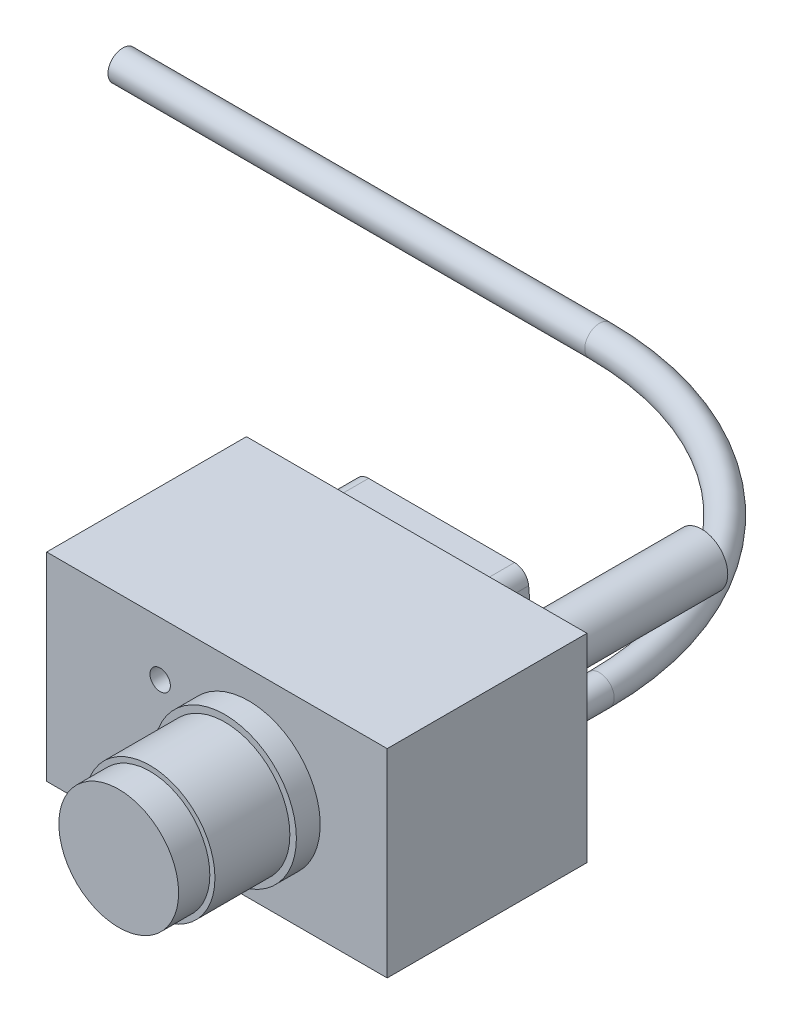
ISO-10303-21;
HEADER;
FILE_DESCRIPTION(('STEP AP214'),'2;1');
FILE_NAME('part.step','',(''),(''),'','','');
FILE_SCHEMA(('AUTOMOTIVE_DESIGN { 1 0 10303 214 1 1 1 1 }'));
ENDSEC;
DATA;
#1=APPLICATION_CONTEXT('core data for automotive mechanical design processes');
#2=APPLICATION_PROTOCOL_DEFINITION('international standard','automotive_design',2000,#1);
#3=PRODUCT_CONTEXT('',#1,'mechanical');
#4=PRODUCT('Part','Part','',(#3));
#5=PRODUCT_RELATED_PRODUCT_CATEGORY('part','',(#4));
#6=PRODUCT_DEFINITION_FORMATION('','',#4);
#7=PRODUCT_DEFINITION_CONTEXT('part definition',#1,'design');
#8=PRODUCT_DEFINITION('design','',#6,#7);
#9=PRODUCT_DEFINITION_SHAPE('','',#8);
#10=(LENGTH_UNIT() NAMED_UNIT(*) SI_UNIT(.MILLI.,.METRE.));
#11=(NAMED_UNIT(*) PLANE_ANGLE_UNIT() SI_UNIT($,.RADIAN.));
#12=(NAMED_UNIT(*) SI_UNIT($,.STERADIAN.) SOLID_ANGLE_UNIT());
#13=UNCERTAINTY_MEASURE_WITH_UNIT(LENGTH_MEASURE(1.E-05),#10,'distance_accuracy_value','');
#14=(GEOMETRIC_REPRESENTATION_CONTEXT(3) GLOBAL_UNCERTAINTY_ASSIGNED_CONTEXT((#13)) GLOBAL_UNIT_ASSIGNED_CONTEXT((#10,
#11,#12)) REPRESENTATION_CONTEXT('',''));
#15=CARTESIAN_POINT('',(0.,0.,0.));
#16=DIRECTION('',(0.,0.,1.));
#17=DIRECTION('',(1.,0.,0.));
#18=AXIS2_PLACEMENT_3D('',#15,#16,#17);
#19=CARTESIAN_POINT('',(38.1,22.225,-22.352));
#20=DIRECTION('',(0.,0.,1.));
#21=DIRECTION('',(1.,0.,0.));
#22=AXIS2_PLACEMENT_3D('',#19,#20,#21);
#23=PLANE('',#22);
#24=CARTESIAN_POINT('',(28.194,0.,-22.352));
#25=DIRECTION('',(0.,0.,1.));
#26=DIRECTION('',(1.,0.,0.));
#27=AXIS2_PLACEMENT_3D('',#24,#25,#26);
#28=CIRCLE('',#27,6.35);
#29=CARTESIAN_POINT('',(34.544,0.,-22.352));
#30=VERTEX_POINT('',#29);
#31=EDGE_CURVE('E41',#30,#30,#28,.F.);
#32=ORIENTED_EDGE('',*,*,#31,.F.);
#33=EDGE_LOOP('',(#32));
#34=FACE_BOUND('',#33,.T.);
#35=DIRECTION('',(-1.,0.,0.));
#36=VECTOR('',#35,1.);
#37=CARTESIAN_POINT('',(38.1,-22.225,-22.352));
#38=LINE('',#37,#36);
#39=CARTESIAN_POINT('',(38.1,-22.225,-22.352));
#40=VERTEX_POINT('',#39);
#41=CARTESIAN_POINT('',(-38.1,-22.225,-22.352));
#42=VERTEX_POINT('',#41);
#43=EDGE_CURVE('E192',#40,#42,#38,.T.);
#44=ORIENTED_EDGE('',*,*,#43,.T.);
#45=DIRECTION('',(0.,-1.,0.));
#46=VECTOR('',#45,1.);
#47=CARTESIAN_POINT('',(-38.1,22.225,-22.352));
#48=LINE('',#47,#46);
#49=CARTESIAN_POINT('',(-38.1,22.225,-22.352));
#50=VERTEX_POINT('',#49);
#51=EDGE_CURVE('E189',#50,#42,#48,.T.);
#52=ORIENTED_EDGE('',*,*,#51,.F.);
#53=DIRECTION('',(-1.,0.,0.));
#54=VECTOR('',#53,1.);
#55=CARTESIAN_POINT('',(38.1,22.225,-22.352));
#56=LINE('',#55,#54);
#57=CARTESIAN_POINT('',(38.1,22.225,-22.352));
#58=VERTEX_POINT('',#57);
#59=EDGE_CURVE('E84',#58,#50,#56,.T.);
#60=ORIENTED_EDGE('',*,*,#59,.F.);
#61=DIRECTION('',(0.,-1.,0.));
#62=VECTOR('',#61,1.);
#63=CARTESIAN_POINT('',(38.1,22.225,-22.352));
#64=LINE('',#63,#62);
#65=EDGE_CURVE('E203',#58,#40,#64,.T.);
#66=ORIENTED_EDGE('',*,*,#65,.T.);
#67=EDGE_LOOP('',(#44,#52,#60,#66));
#68=FACE_BOUND('',#67,.T.);
#69=CARTESIAN_POINT('',(9.50530829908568,8.22959999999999,-22.352));
#70=DIRECTION('',(0.,0.,-1.));
#71=DIRECTION('',(-1.,0.,0.));
#72=AXIS2_PLACEMENT_3D('',#69,#70,#71);
#73=CIRCLE('',#72,3.175);
#74=CARTESIAN_POINT('',(12.668226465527,8.50631948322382,-22.352));
#75=VERTEX_POINT('',#74);
#76=CARTESIAN_POINT('',(9.50530829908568,5.05459999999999,-22.352));
#77=VERTEX_POINT('',#76);
#78=EDGE_CURVE('E157',#75,#77,#73,.T.);
#79=ORIENTED_EDGE('',*,*,#78,.F.);
#80=DIRECTION('',(-0.087155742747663,0.996194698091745,0.));
#81=VECTOR('',#80,1.);
#82=CARTESIAN_POINT('',(12.668226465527,8.50631948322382,-22.352));
#83=LINE('',#82,#81);
#84=CARTESIAN_POINT('',(12.3437835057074,12.2147194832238,-22.352));
#85=VERTEX_POINT('',#84);
#86=EDGE_CURVE('E153',#75,#85,#83,.T.);
#87=ORIENTED_EDGE('',*,*,#86,.T.);
#88=CARTESIAN_POINT('',(9.18086533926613,11.938,-22.352));
#89=DIRECTION('',(0.,0.,-1.));
#90=DIRECTION('',(-1.,0.,0.));
#91=AXIS2_PLACEMENT_3D('',#88,#89,#90);
#92=CIRCLE('',#91,3.175);
#93=CARTESIAN_POINT('',(9.18086533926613,15.113,-22.352));
#94=VERTEX_POINT('',#93);
#95=EDGE_CURVE('E48',#94,#85,#92,.T.);
#96=ORIENTED_EDGE('',*,*,#95,.F.);
#97=DIRECTION('',(1.,0.,0.));
#98=VECTOR('',#97,1.);
#99=CARTESIAN_POINT('',(-23.4684124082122,15.113,-22.352));
#100=LINE('',#99,#98);
#101=CARTESIAN_POINT('',(-23.4684124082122,15.113,-22.352));
#102=VERTEX_POINT('',#101);
#103=EDGE_CURVE('E250',#102,#94,#100,.T.);
#104=ORIENTED_EDGE('',*,*,#103,.F.);
#105=CARTESIAN_POINT('',(-23.4684124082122,11.938,-22.352));
#106=DIRECTION('',(0.,0.,-1.));
#107=DIRECTION('',(-1.,0.,0.));
#108=AXIS2_PLACEMENT_3D('',#105,#106,#107);
#109=CIRCLE('',#108,3.17500000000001);
#110=CARTESIAN_POINT('',(-26.6313305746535,12.2147194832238,-22.352));
#111=VERTEX_POINT('',#110);
#112=EDGE_CURVE('E248',#111,#102,#109,.T.);
#113=ORIENTED_EDGE('',*,*,#112,.F.);
#114=DIRECTION('',(-0.0871557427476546,-0.996194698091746,0.));
#115=VECTOR('',#114,1.);
#116=CARTESIAN_POINT('',(-26.6313305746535,12.2147194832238,-22.352));
#117=LINE('',#116,#115);
#118=CARTESIAN_POINT('',(-26.955773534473,8.50631948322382,-22.352));
#119=VERTEX_POINT('',#118);
#120=EDGE_CURVE('E245',#111,#119,#117,.T.);
#121=ORIENTED_EDGE('',*,*,#120,.T.);
#122=CARTESIAN_POINT('',(-23.7928553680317,8.22959999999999,-22.352));
#123=DIRECTION('',(0.,0.,1.));
#124=DIRECTION('',(1.,0.,0.));
#125=AXIS2_PLACEMENT_3D('',#122,#123,#124);
#126=CIRCLE('',#125,3.175);
#127=CARTESIAN_POINT('',(-23.7928553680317,5.05459999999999,-22.352));
#128=VERTEX_POINT('',#127);
#129=EDGE_CURVE('E242',#119,#128,#126,.T.);
#130=ORIENTED_EDGE('',*,*,#129,.T.);
#131=DIRECTION('',(-1.,0.,0.));
#132=VECTOR('',#131,1.);
#133=CARTESIAN_POINT('',(9.50530829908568,5.05459999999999,-22.352));
#134=LINE('',#133,#132);
#135=EDGE_CURVE('E240',#77,#128,#134,.T.);
#136=ORIENTED_EDGE('',*,*,#135,.F.);
#137=EDGE_LOOP('',(#79,#87,#96,#104,#113,#121,#130,#136));
#138=FACE_BOUND('',#137,.T.);
#139=CARTESIAN_POINT('',(28.194,13.843,-22.352));
#140=DIRECTION('',(0.,0.,1.));
#141=DIRECTION('',(1.,0.,0.));
#142=AXIS2_PLACEMENT_3D('',#139,#140,#141);
#143=CIRCLE('',#142,5.842);
#144=CARTESIAN_POINT('',(34.036,13.843,-22.352));
#145=VERTEX_POINT('',#144);
#146=EDGE_CURVE('E11',#145,#145,#143,.F.);
#147=ORIENTED_EDGE('',*,*,#146,.F.);
#148=EDGE_LOOP('',(#147));
#149=FACE_BOUND('',#148,.T.);
#150=ADVANCED_FACE('F33',(#34,#68,#138,#149),#23,.F.);
#151=CARTESIAN_POINT('',(28.194,0.,-24.892));
#152=DIRECTION('',(0.,0.,-1.));
#153=DIRECTION('',(-1.,0.,0.));
#154=AXIS2_PLACEMENT_3D('',#151,#152,#153);
#155=PLANE('',#154);
#156=CARTESIAN_POINT('',(28.194,0.,-24.892));
#157=DIRECTION('',(0.,0.,-1.));
#158=DIRECTION('',(-1.,0.,0.));
#159=AXIS2_PLACEMENT_3D('',#156,#157,#158);
#160=CIRCLE('',#159,6.35);
#161=CARTESIAN_POINT('',(21.844,0.,-24.892));
#162=VERTEX_POINT('',#161);
#163=EDGE_CURVE('E211',#162,#162,#160,.T.);
#164=ORIENTED_EDGE('',*,*,#163,.T.);
#165=EDGE_LOOP('',(#164));
#166=FACE_BOUND('',#165,.T.);
#167=CARTESIAN_POINT('',(28.194,0.,-24.892));
#168=DIRECTION('',(0.,0.,-1.));
#169=DIRECTION('',(-1.,0.,0.));
#170=AXIS2_PLACEMENT_3D('',#167,#168,#169);
#171=CIRCLE('',#170,3.302);
#172=CARTESIAN_POINT('',(24.892,0.,-24.892));
#173=VERTEX_POINT('',#172);
#174=EDGE_CURVE('E209',#173,#173,#171,.F.);
#175=ORIENTED_EDGE('',*,*,#174,.T.);
#176=EDGE_LOOP('',(#175));
#177=FACE_BOUND('',#176,.T.);
#178=ADVANCED_FACE('F298',(#166,#177),#155,.T.);
#179=CARTESIAN_POINT('',(7.11200000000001,0.,44.45));
#180=DIRECTION('',(0.,0.,1.));
#181=DIRECTION('',(1.,0.,0.));
#182=AXIS2_PLACEMENT_3D('',#179,#180,#181);
#183=PLANE('',#182);
#184=CARTESIAN_POINT('',(7.11200000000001,0.,44.45));
#185=DIRECTION('',(0.,0.,1.));
#186=DIRECTION('',(1.,0.,0.));
#187=AXIS2_PLACEMENT_3D('',#184,#185,#186);
#188=CIRCLE('',#187,14.5415);
#189=CARTESIAN_POINT('',(21.6535,0.,44.45));
#190=VERTEX_POINT('',#189);
#191=EDGE_CURVE('E171',#190,#190,#188,.T.);
#192=ORIENTED_EDGE('',*,*,#191,.T.);
#193=EDGE_LOOP('',(#192));
#194=FACE_BOUND('',#193,.T.);
#195=CARTESIAN_POINT('',(7.11200000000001,0.,44.45));
#196=DIRECTION('',(0.,0.,1.));
#197=DIRECTION('',(1.,0.,0.));
#198=AXIS2_PLACEMENT_3D('',#195,#196,#197);
#199=CIRCLE('',#198,13.3985);
#200=CARTESIAN_POINT('',(20.5105,0.,44.45));
#201=VERTEX_POINT('',#200);
#202=EDGE_CURVE('E159',#201,#201,#199,.T.);
#203=ORIENTED_EDGE('',*,*,#202,.F.);
#204=EDGE_LOOP('',(#203));
#205=FACE_BOUND('',#204,.T.);
#206=ADVANCED_FACE('F303',(#194,#205),#183,.T.);
#207=CARTESIAN_POINT('',(7.11200000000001,0.,27.686));
#208=DIRECTION('',(0.,0.,1.));
#209=DIRECTION('',(1.,0.,0.));
#210=AXIS2_PLACEMENT_3D('',#207,#208,#209);
#211=PLANE('',#210);
#212=CARTESIAN_POINT('',(7.11200000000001,0.,27.686));
#213=DIRECTION('',(0.,0.,1.));
#214=DIRECTION('',(1.,0.,0.));
#215=AXIS2_PLACEMENT_3D('',#212,#213,#214);
#216=CIRCLE('',#215,16.002);
#217=CARTESIAN_POINT('',(23.114,0.,27.686));
#218=VERTEX_POINT('',#217);
#219=EDGE_CURVE('E174',#218,#218,#216,.T.);
#220=ORIENTED_EDGE('',*,*,#219,.T.);
#221=EDGE_LOOP('',(#220));
#222=FACE_BOUND('',#221,.T.);
#223=CARTESIAN_POINT('',(7.11200000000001,0.,27.686));
#224=DIRECTION('',(0.,0.,1.));
#225=DIRECTION('',(1.,0.,0.));
#226=AXIS2_PLACEMENT_3D('',#223,#224,#225);
#227=CIRCLE('',#226,14.5415);
#228=CARTESIAN_POINT('',(21.6535,0.,27.686));
#229=VERTEX_POINT('',#228);
#230=EDGE_CURVE('E169',#229,#229,#227,.T.);
#231=ORIENTED_EDGE('',*,*,#230,.F.);
#232=EDGE_LOOP('',(#231));
#233=FACE_BOUND('',#232,.T.);
#234=ADVANCED_FACE('F317',(#222,#233),#211,.T.);
#235=CARTESIAN_POINT('',(-38.1,22.225,22.352));
#236=DIRECTION('',(0.,0.,-1.));
#237=DIRECTION('',(-1.,0.,0.));
#238=AXIS2_PLACEMENT_3D('',#235,#236,#237);
#239=PLANE('',#238);
#240=CARTESIAN_POINT('',(-12.7,10.16,22.352));
#241=DIRECTION('',(0.,0.,1.));
#242=DIRECTION('',(1.,0.,0.));
#243=AXIS2_PLACEMENT_3D('',#240,#241,#242);
#244=CIRCLE('',#243,2.286);
#245=CARTESIAN_POINT('',(-10.414,10.16,22.352));
#246=VERTEX_POINT('',#245);
#247=EDGE_CURVE('E511',#246,#246,#244,.T.);
#248=ORIENTED_EDGE('',*,*,#247,.F.);
#249=EDGE_LOOP('',(#248));
#250=FACE_BOUND('',#249,.T.);
#251=CARTESIAN_POINT('',(-12.7,-10.16,22.352));
#252=DIRECTION('',(0.,0.,1.));
#253=DIRECTION('',(1.,0.,0.));
#254=AXIS2_PLACEMENT_3D('',#251,#252,#253);
#255=CIRCLE('',#254,2.286);
#256=CARTESIAN_POINT('',(-10.414,-10.16,22.352));
#257=VERTEX_POINT('',#256);
#258=EDGE_CURVE('E510',#257,#257,#255,.T.);
#259=ORIENTED_EDGE('',*,*,#258,.F.);
#260=EDGE_LOOP('',(#259));
#261=FACE_BOUND('',#260,.T.);
#262=DIRECTION('',(1.,0.,0.));
#263=VECTOR('',#262,1.);
#264=CARTESIAN_POINT('',(-38.1,-22.225,22.352));
#265=LINE('',#264,#263);
#266=CARTESIAN_POINT('',(-38.1,-22.225,22.352));
#267=VERTEX_POINT('',#266);
#268=CARTESIAN_POINT('',(38.1,-22.225,22.352));
#269=VERTEX_POINT('',#268);
#270=EDGE_CURVE('E182',#267,#269,#265,.T.);
#271=ORIENTED_EDGE('',*,*,#270,.T.);
#272=DIRECTION('',(0.,-1.,0.));
#273=VECTOR('',#272,1.);
#274=CARTESIAN_POINT('',(38.1,22.225,22.352));
#275=LINE('',#274,#273);
#276=CARTESIAN_POINT('',(38.1,22.225,22.352));
#277=VERTEX_POINT('',#276);
#278=EDGE_CURVE('E201',#277,#269,#275,.T.);
#279=ORIENTED_EDGE('',*,*,#278,.F.);
#280=DIRECTION('',(1.,0.,0.));
#281=VECTOR('',#280,1.);
#282=CARTESIAN_POINT('',(-38.1,22.225,22.352));
#283=LINE('',#282,#281);
#284=CARTESIAN_POINT('',(-38.1,22.225,22.352));
#285=VERTEX_POINT('',#284);
#286=EDGE_CURVE('E187',#285,#277,#283,.T.);
#287=ORIENTED_EDGE('',*,*,#286,.F.);
#288=DIRECTION('',(0.,-1.,0.));
#289=VECTOR('',#288,1.);
#290=CARTESIAN_POINT('',(-38.1,22.225,22.352));
#291=LINE('',#290,#289);
#292=EDGE_CURVE('E57',#285,#267,#291,.T.);
#293=ORIENTED_EDGE('',*,*,#292,.T.);
#294=EDGE_LOOP('',(#271,#279,#287,#293));
#295=FACE_BOUND('',#294,.T.);
#296=CARTESIAN_POINT('',(7.11200000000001,0.,22.352));
#297=DIRECTION('',(0.,0.,-1.));
#298=DIRECTION('',(-1.,0.,0.));
#299=AXIS2_PLACEMENT_3D('',#296,#297,#298);
#300=CIRCLE('',#299,16.002);
#301=CARTESIAN_POINT('',(-8.89,0.,22.352));
#302=VERTEX_POINT('',#301);
#303=EDGE_CURVE('E200',#302,#302,#300,.F.);
#304=ORIENTED_EDGE('',*,*,#303,.F.);
#305=EDGE_LOOP('',(#304));
#306=FACE_BOUND('',#305,.T.);
#307=ADVANCED_FACE('F314',(#250,#261,#295,#306),#239,.F.);
#308=CARTESIAN_POINT('',(-38.1,22.225,22.352));
#309=DIRECTION('',(-1.,0.,0.));
#310=DIRECTION('',(0.,0.,1.));
#311=AXIS2_PLACEMENT_3D('',#308,#309,#310);
#312=PLANE('',#311);
#313=DIRECTION('',(0.,0.,-1.));
#314=VECTOR('',#313,1.);
#315=CARTESIAN_POINT('',(-38.1,-22.225,22.352));
#316=LINE('',#315,#314);
#317=EDGE_CURVE('E179',#267,#42,#316,.T.);
#318=ORIENTED_EDGE('',*,*,#317,.F.);
#319=ORIENTED_EDGE('',*,*,#292,.F.);
#320=DIRECTION('',(0.,0.,-1.));
#321=VECTOR('',#320,1.);
#322=CARTESIAN_POINT('',(-38.1,22.225,22.352));
#323=LINE('',#322,#321);
#324=EDGE_CURVE('E180',#285,#50,#323,.T.);
#325=ORIENTED_EDGE('',*,*,#324,.T.);
#326=ORIENTED_EDGE('',*,*,#51,.T.);
#327=EDGE_LOOP('',(#318,#319,#325,#326));
#328=FACE_BOUND('',#327,.T.);
#329=ADVANCED_FACE('F35',(#328),#312,.T.);
#330=CARTESIAN_POINT('',(38.1,22.225,-22.352));
#331=DIRECTION('',(1.,0.,0.));
#332=DIRECTION('',(0.,0.,-1.));
#333=AXIS2_PLACEMENT_3D('',#330,#331,#332);
#334=PLANE('',#333);
#335=DIRECTION('',(0.,0.,1.));
#336=VECTOR('',#335,1.);
#337=CARTESIAN_POINT('',(38.1,-22.225,-22.352));
#338=LINE('',#337,#336);
#339=EDGE_CURVE('E195',#40,#269,#338,.T.);
#340=ORIENTED_EDGE('',*,*,#339,.F.);
#341=ORIENTED_EDGE('',*,*,#65,.F.);
#342=DIRECTION('',(0.,0.,1.));
#343=VECTOR('',#342,1.);
#344=CARTESIAN_POINT('',(38.1,22.225,-22.352));
#345=LINE('',#344,#343);
#346=EDGE_CURVE('E184',#58,#277,#345,.T.);
#347=ORIENTED_EDGE('',*,*,#346,.T.);
#348=ORIENTED_EDGE('',*,*,#278,.T.);
#349=EDGE_LOOP('',(#340,#341,#347,#348));
#350=FACE_BOUND('',#349,.T.);
#351=ADVANCED_FACE('F309',(#350),#334,.T.);
#352=CARTESIAN_POINT('',(-38.1,22.225,22.352));
#353=DIRECTION('',(0.,-1.,0.));
#354=DIRECTION('',(0.,0.,-1.));
#355=AXIS2_PLACEMENT_3D('',#352,#353,#354);
#356=PLANE('',#355);
#357=ORIENTED_EDGE('',*,*,#324,.F.);
#358=ORIENTED_EDGE('',*,*,#286,.T.);
#359=ORIENTED_EDGE('',*,*,#346,.F.);
#360=ORIENTED_EDGE('',*,*,#59,.T.);
#361=EDGE_LOOP('',(#357,#358,#359,#360));
#362=FACE_BOUND('',#361,.T.);
#363=ADVANCED_FACE('F312',(#362),#356,.F.);
#364=CARTESIAN_POINT('',(-38.1,-22.225,22.352));
#365=DIRECTION('',(0.,-1.,0.));
#366=DIRECTION('',(0.,0.,-1.));
#367=AXIS2_PLACEMENT_3D('',#364,#365,#366);
#368=PLANE('',#367);
#369=ORIENTED_EDGE('',*,*,#317,.T.);
#370=ORIENTED_EDGE('',*,*,#43,.F.);
#371=ORIENTED_EDGE('',*,*,#339,.T.);
#372=ORIENTED_EDGE('',*,*,#270,.F.);
#373=EDGE_LOOP('',(#369,#370,#371,#372));
#374=FACE_BOUND('',#373,.T.);
#375=ADVANCED_FACE('F319',(#374),#368,.T.);
#376=CARTESIAN_POINT('',(7.11200000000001,0.,27.686));
#377=DIRECTION('',(0.,0.,-1.));
#378=DIRECTION('',(-1.,0.,0.));
#379=AXIS2_PLACEMENT_3D('',#376,#377,#378);
#380=CYLINDRICAL_SURFACE('',#379,16.002);
#381=ORIENTED_EDGE('',*,*,#219,.F.);
#382=EDGE_LOOP('',(#381));
#383=FACE_BOUND('',#382,.T.);
#384=ORIENTED_EDGE('',*,*,#303,.T.);
#385=EDGE_LOOP('',(#384));
#386=FACE_BOUND('',#385,.T.);
#387=ADVANCED_FACE('F322',(#383,#386),#380,.T.);
#388=CARTESIAN_POINT('',(7.11200000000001,0.,44.45));
#389=DIRECTION('',(0.,0.,-1.));
#390=DIRECTION('',(-1.,0.,0.));
#391=AXIS2_PLACEMENT_3D('',#388,#389,#390);
#392=CYLINDRICAL_SURFACE('',#391,14.5415);
#393=ORIENTED_EDGE('',*,*,#191,.F.);
#394=EDGE_LOOP('',(#393));
#395=FACE_BOUND('',#394,.T.);
#396=ORIENTED_EDGE('',*,*,#230,.T.);
#397=EDGE_LOOP('',(#396));
#398=FACE_BOUND('',#397,.T.);
#399=ADVANCED_FACE('F328',(#395,#398),#392,.T.);
#400=CARTESIAN_POINT('',(7.11200000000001,0.,51.435));
#401=DIRECTION('',(0.,0.,-1.));
#402=DIRECTION('',(-1.,0.,0.));
#403=AXIS2_PLACEMENT_3D('',#400,#401,#402);
#404=CYLINDRICAL_SURFACE('',#403,13.3985);
#405=CARTESIAN_POINT('',(7.11200000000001,0.,51.435));
#406=DIRECTION('',(0.,0.,1.));
#407=DIRECTION('',(1.,0.,0.));
#408=AXIS2_PLACEMENT_3D('',#405,#406,#407);
#409=CIRCLE('',#408,13.3985);
#410=CARTESIAN_POINT('',(20.5105,0.,51.435));
#411=VERTEX_POINT('',#410);
#412=EDGE_CURVE('E162',#411,#411,#409,.T.);
#413=ORIENTED_EDGE('',*,*,#412,.F.);
#414=EDGE_LOOP('',(#413));
#415=FACE_BOUND('',#414,.T.);
#416=ORIENTED_EDGE('',*,*,#202,.T.);
#417=EDGE_LOOP('',(#416));
#418=FACE_BOUND('',#417,.T.);
#419=ADVANCED_FACE('F335',(#415,#418),#404,.T.);
#420=CARTESIAN_POINT('',(7.11200000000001,0.,51.435));
#421=DIRECTION('',(0.,0.,1.));
#422=DIRECTION('',(1.,0.,0.));
#423=AXIS2_PLACEMENT_3D('',#420,#421,#422);
#424=PLANE('',#423);
#425=ORIENTED_EDGE('',*,*,#412,.T.);
#426=EDGE_LOOP('',(#425));
#427=FACE_BOUND('',#426,.T.);
#428=ADVANCED_FACE('F342',(#427),#424,.T.);
#429=CARTESIAN_POINT('',(9.50530829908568,8.22959999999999,-35.052));
#430=DIRECTION('',(0.,0.,1.));
#431=DIRECTION('',(1.,0.,0.));
#432=AXIS2_PLACEMENT_3D('',#429,#430,#431);
#433=CYLINDRICAL_SURFACE('',#432,3.175);
#434=ORIENTED_EDGE('',*,*,#78,.T.);
#435=DIRECTION('',(0.,0.,1.));
#436=VECTOR('',#435,1.);
#437=CARTESIAN_POINT('',(9.50530829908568,5.05459999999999,-35.052));
#438=LINE('',#437,#436);
#439=CARTESIAN_POINT('',(9.50530829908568,5.05459999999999,-35.052));
#440=VERTEX_POINT('',#439);
#441=EDGE_CURVE('E138',#440,#77,#438,.T.);
#442=ORIENTED_EDGE('',*,*,#441,.F.);
#443=CARTESIAN_POINT('',(9.50530829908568,8.22959999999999,-35.052));
#444=DIRECTION('',(0.,0.,-1.));
#445=DIRECTION('',(-1.,0.,0.));
#446=AXIS2_PLACEMENT_3D('',#443,#444,#445);
#447=CIRCLE('',#446,3.175);
#448=CARTESIAN_POINT('',(12.668226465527,8.50631948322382,-35.052));
#449=VERTEX_POINT('',#448);
#450=EDGE_CURVE('E145',#449,#440,#447,.T.);
#451=ORIENTED_EDGE('',*,*,#450,.F.);
#452=DIRECTION('',(0.,0.,1.));
#453=VECTOR('',#452,1.);
#454=CARTESIAN_POINT('',(12.668226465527,8.50631948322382,-35.052));
#455=LINE('',#454,#453);
#456=EDGE_CURVE('E238',#449,#75,#455,.T.);
#457=ORIENTED_EDGE('',*,*,#456,.T.);
#458=EDGE_LOOP('',(#434,#442,#451,#457));
#459=FACE_BOUND('',#458,.T.);
#460=ADVANCED_FACE('F155',(#459),#433,.T.);
#461=CARTESIAN_POINT('',(9.50530829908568,5.05459999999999,-35.052));
#462=DIRECTION('',(0.,1.,0.));
#463=DIRECTION('',(0.,0.,1.));
#464=AXIS2_PLACEMENT_3D('',#461,#462,#463);
#465=PLANE('',#464);
#466=ORIENTED_EDGE('',*,*,#135,.T.);
#467=DIRECTION('',(0.,0.,1.));
#468=VECTOR('',#467,1.);
#469=CARTESIAN_POINT('',(-23.7928553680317,5.05459999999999,-35.052));
#470=LINE('',#469,#468);
#471=CARTESIAN_POINT('',(-23.7928553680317,5.05459999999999,-35.052));
#472=VERTEX_POINT('',#471);
#473=EDGE_CURVE('E140',#472,#128,#470,.T.);
#474=ORIENTED_EDGE('',*,*,#473,.F.);
#475=DIRECTION('',(-1.,0.,0.));
#476=VECTOR('',#475,1.);
#477=CARTESIAN_POINT('',(9.50530829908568,5.05459999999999,-35.052));
#478=LINE('',#477,#476);
#479=EDGE_CURVE('E133',#440,#472,#478,.T.);
#480=ORIENTED_EDGE('',*,*,#479,.F.);
#481=ORIENTED_EDGE('',*,*,#441,.T.);
#482=EDGE_LOOP('',(#466,#474,#480,#481));
#483=FACE_BOUND('',#482,.T.);
#484=ADVANCED_FACE('F136',(#483),#465,.F.);
#485=CARTESIAN_POINT('',(-23.7928553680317,8.22959999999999,-35.052));
#486=DIRECTION('',(0.,0.,1.));
#487=DIRECTION('',(1.,0.,0.));
#488=AXIS2_PLACEMENT_3D('',#485,#486,#487);
#489=CYLINDRICAL_SURFACE('',#488,3.175);
#490=ORIENTED_EDGE('',*,*,#129,.F.);
#491=DIRECTION('',(0.,0.,1.));
#492=VECTOR('',#491,1.);
#493=CARTESIAN_POINT('',(-26.955773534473,8.50631948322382,-35.052));
#494=LINE('',#493,#492);
#495=CARTESIAN_POINT('',(-26.955773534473,8.50631948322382,-35.052));
#496=VERTEX_POINT('',#495);
#497=EDGE_CURVE('E164',#496,#119,#494,.T.);
#498=ORIENTED_EDGE('',*,*,#497,.F.);
#499=CARTESIAN_POINT('',(-23.7928553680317,8.22959999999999,-35.052));
#500=DIRECTION('',(0.,0.,1.));
#501=DIRECTION('',(1.,0.,0.));
#502=AXIS2_PLACEMENT_3D('',#499,#500,#501);
#503=CIRCLE('',#502,3.175);
#504=EDGE_CURVE('E144',#496,#472,#503,.T.);
#505=ORIENTED_EDGE('',*,*,#504,.T.);
#506=ORIENTED_EDGE('',*,*,#473,.T.);
#507=EDGE_LOOP('',(#490,#498,#505,#506));
#508=FACE_BOUND('',#507,.T.);
#509=ADVANCED_FACE('F271',(#508),#489,.T.);
#510=CARTESIAN_POINT('',(-26.6313305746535,12.2147194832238,-35.052));
#511=DIRECTION('',(-0.996194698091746,0.0871557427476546,0.));
#512=DIRECTION('',(-0.0871557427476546,-0.996194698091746,0.));
#513=AXIS2_PLACEMENT_3D('',#510,#511,#512);
#514=PLANE('',#513);
#515=ORIENTED_EDGE('',*,*,#120,.F.);
#516=DIRECTION('',(0.,0.,1.));
#517=VECTOR('',#516,1.);
#518=CARTESIAN_POINT('',(-26.6313305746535,12.2147194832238,-35.052));
#519=LINE('',#518,#517);
#520=CARTESIAN_POINT('',(-26.6313305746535,12.2147194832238,-35.052));
#521=VERTEX_POINT('',#520);
#522=EDGE_CURVE('E263',#521,#111,#519,.T.);
#523=ORIENTED_EDGE('',*,*,#522,.F.);
#524=DIRECTION('',(-0.0871557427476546,-0.996194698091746,0.));
#525=VECTOR('',#524,1.);
#526=CARTESIAN_POINT('',(-26.6313305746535,12.2147194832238,-35.052));
#527=LINE('',#526,#525);
#528=EDGE_CURVE('E228',#521,#496,#527,.T.);
#529=ORIENTED_EDGE('',*,*,#528,.T.);
#530=ORIENTED_EDGE('',*,*,#497,.T.);
#531=EDGE_LOOP('',(#515,#523,#529,#530));
#532=FACE_BOUND('',#531,.T.);
#533=ADVANCED_FACE('F267',(#532),#514,.T.);
#534=CARTESIAN_POINT('',(-23.4684124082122,11.938,-35.052));
#535=DIRECTION('',(0.,0.,1.));
#536=DIRECTION('',(1.,0.,0.));
#537=AXIS2_PLACEMENT_3D('',#534,#535,#536);
#538=CYLINDRICAL_SURFACE('',#537,3.17500000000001);
#539=ORIENTED_EDGE('',*,*,#112,.T.);
#540=DIRECTION('',(0.,0.,1.));
#541=VECTOR('',#540,1.);
#542=CARTESIAN_POINT('',(-23.4684124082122,15.113,-35.052));
#543=LINE('',#542,#541);
#544=CARTESIAN_POINT('',(-23.4684124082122,15.113,-35.052));
#545=VERTEX_POINT('',#544);
#546=EDGE_CURVE('E260',#545,#102,#543,.T.);
#547=ORIENTED_EDGE('',*,*,#546,.F.);
#548=CARTESIAN_POINT('',(-23.4684124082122,11.938,-35.052));
#549=DIRECTION('',(0.,0.,-1.));
#550=DIRECTION('',(-1.,0.,0.));
#551=AXIS2_PLACEMENT_3D('',#548,#549,#550);
#552=CIRCLE('',#551,3.17500000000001);
#553=EDGE_CURVE('E231',#521,#545,#552,.T.);
#554=ORIENTED_EDGE('',*,*,#553,.F.);
#555=ORIENTED_EDGE('',*,*,#522,.T.);
#556=EDGE_LOOP('',(#539,#547,#554,#555));
#557=FACE_BOUND('',#556,.T.);
#558=ADVANCED_FACE('F277',(#557),#538,.T.);
#559=CARTESIAN_POINT('',(-23.4684124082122,15.113,-35.052));
#560=DIRECTION('',(0.,-1.,0.));
#561=DIRECTION('',(1.,0.,0.));
#562=AXIS2_PLACEMENT_3D('',#559,#560,#561);
#563=PLANE('',#562);
#564=ORIENTED_EDGE('',*,*,#103,.T.);
#565=DIRECTION('',(0.,0.,1.));
#566=VECTOR('',#565,1.);
#567=CARTESIAN_POINT('',(9.18086533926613,15.113,-35.052));
#568=LINE('',#567,#566);
#569=CARTESIAN_POINT('',(9.18086533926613,15.113,-35.052));
#570=VERTEX_POINT('',#569);
#571=EDGE_CURVE('E258',#570,#94,#568,.T.);
#572=ORIENTED_EDGE('',*,*,#571,.F.);
#573=DIRECTION('',(1.,0.,0.));
#574=VECTOR('',#573,1.);
#575=CARTESIAN_POINT('',(-23.4684124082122,15.113,-35.052));
#576=LINE('',#575,#574);
#577=EDGE_CURVE('E233',#545,#570,#576,.T.);
#578=ORIENTED_EDGE('',*,*,#577,.F.);
#579=ORIENTED_EDGE('',*,*,#546,.T.);
#580=EDGE_LOOP('',(#564,#572,#578,#579));
#581=FACE_BOUND('',#580,.T.);
#582=ADVANCED_FACE('F281',(#581),#563,.F.);
#583=CARTESIAN_POINT('',(9.18086533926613,11.938,-35.052));
#584=DIRECTION('',(0.,0.,1.));
#585=DIRECTION('',(1.,0.,0.));
#586=AXIS2_PLACEMENT_3D('',#583,#584,#585);
#587=CYLINDRICAL_SURFACE('',#586,3.175);
#588=ORIENTED_EDGE('',*,*,#95,.T.);
#589=DIRECTION('',(0.,0.,1.));
#590=VECTOR('',#589,1.);
#591=CARTESIAN_POINT('',(12.3437835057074,12.2147194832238,-35.052));
#592=LINE('',#591,#590);
#593=CARTESIAN_POINT('',(12.3437835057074,12.2147194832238,-35.052));
#594=VERTEX_POINT('',#593);
#595=EDGE_CURVE('E256',#594,#85,#592,.T.);
#596=ORIENTED_EDGE('',*,*,#595,.F.);
#597=CARTESIAN_POINT('',(9.18086533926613,11.938,-35.052));
#598=DIRECTION('',(0.,0.,-1.));
#599=DIRECTION('',(-1.,0.,0.));
#600=AXIS2_PLACEMENT_3D('',#597,#598,#599);
#601=CIRCLE('',#600,3.175);
#602=EDGE_CURVE('E235',#570,#594,#601,.T.);
#603=ORIENTED_EDGE('',*,*,#602,.F.);
#604=ORIENTED_EDGE('',*,*,#571,.T.);
#605=EDGE_LOOP('',(#588,#596,#603,#604));
#606=FACE_BOUND('',#605,.T.);
#607=ADVANCED_FACE('F284',(#606),#587,.T.);
#608=CARTESIAN_POINT('',(12.668226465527,8.50631948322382,-35.052));
#609=DIRECTION('',(0.996194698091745,0.087155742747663,0.));
#610=DIRECTION('',(-0.087155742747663,0.996194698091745,0.));
#611=AXIS2_PLACEMENT_3D('',#608,#609,#610);
#612=PLANE('',#611);
#613=ORIENTED_EDGE('',*,*,#86,.F.);
#614=ORIENTED_EDGE('',*,*,#456,.F.);
#615=DIRECTION('',(-0.087155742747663,0.996194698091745,0.));
#616=VECTOR('',#615,1.);
#617=CARTESIAN_POINT('',(12.668226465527,8.50631948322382,-35.052));
#618=LINE('',#617,#616);
#619=EDGE_CURVE('E151',#449,#594,#618,.T.);
#620=ORIENTED_EDGE('',*,*,#619,.T.);
#621=ORIENTED_EDGE('',*,*,#595,.T.);
#622=EDGE_LOOP('',(#613,#614,#620,#621));
#623=FACE_BOUND('',#622,.T.);
#624=ADVANCED_FACE('F287',(#623),#612,.T.);
#625=CARTESIAN_POINT('',(9.50530829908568,8.22959999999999,-35.052));
#626=DIRECTION('',(0.,0.,-1.));
#627=DIRECTION('',(-1.,0.,0.));
#628=AXIS2_PLACEMENT_3D('',#625,#626,#627);
#629=PLANE('',#628);
#630=ORIENTED_EDGE('',*,*,#450,.T.);
#631=ORIENTED_EDGE('',*,*,#479,.T.);
#632=ORIENTED_EDGE('',*,*,#504,.F.);
#633=ORIENTED_EDGE('',*,*,#528,.F.);
#634=ORIENTED_EDGE('',*,*,#553,.T.);
#635=ORIENTED_EDGE('',*,*,#577,.T.);
#636=ORIENTED_EDGE('',*,*,#602,.T.);
#637=ORIENTED_EDGE('',*,*,#619,.F.);
#638=EDGE_LOOP('',(#630,#631,#632,#633,#634,#635,#636,#637));
#639=FACE_BOUND('',#638,.T.);
#640=ADVANCED_FACE('F149',(#639),#629,.T.);
#641=CARTESIAN_POINT('',(28.194,0.,-24.892));
#642=DIRECTION('',(0.,0.,1.));
#643=DIRECTION('',(1.,0.,0.));
#644=AXIS2_PLACEMENT_3D('',#641,#642,#643);
#645=CYLINDRICAL_SURFACE('',#644,6.35);
#646=ORIENTED_EDGE('',*,*,#163,.F.);
#647=EDGE_LOOP('',(#646));
#648=FACE_BOUND('',#647,.T.);
#649=ORIENTED_EDGE('',*,*,#31,.T.);
#650=EDGE_LOOP('',(#649));
#651=FACE_BOUND('',#650,.T.);
#652=ADVANCED_FACE('F294',(#648,#651),#645,.T.);
#653=CARTESIAN_POINT('',(-39.4969999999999,7.0830860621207E-13,-102.743));
#654=DIRECTION('',(-1.,0.,0.));
#655=DIRECTION('',(0.,-1.,0.));
#656=AXIS2_PLACEMENT_3D('',#653,#654,#655);
#657=CYLINDRICAL_SURFACE('',#656,3.302);
#658=CARTESIAN_POINT('',(-39.4969999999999,7.0830860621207E-13,-102.743));
#659=DIRECTION('',(-1.,0.,0.));
#660=DIRECTION('',(0.,0.,1.));
#661=AXIS2_PLACEMENT_3D('',#658,#659,#660);
#662=CIRCLE('',#661,3.302);
#663=CARTESIAN_POINT('',(-39.4969999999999,7.0830860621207E-13,-106.045));
#664=VERTEX_POINT('',#663);
#665=EDGE_CURVE('E218',#664,#664,#662,.T.);
#666=ORIENTED_EDGE('',*,*,#665,.T.);
#667=EDGE_LOOP('',(#666));
#668=FACE_BOUND('',#667,.T.);
#669=CARTESIAN_POINT('',(-146.177,1.82459233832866E-12,-102.742999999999));
#670=DIRECTION('',(-1.,0.,0.));
#671=DIRECTION('',(0.,0.,1.));
#672=AXIS2_PLACEMENT_3D('',#669,#670,#671);
#673=CIRCLE('',#672,3.302);
#674=CARTESIAN_POINT('',(-146.177,1.79004069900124E-12,-99.4409999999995));
#675=VERTEX_POINT('',#674);
#676=EDGE_CURVE('E212',#675,#675,#673,.T.);
#677=ORIENTED_EDGE('',*,*,#676,.F.);
#678=EDGE_LOOP('',(#677));
#679=FACE_BOUND('',#678,.T.);
#680=ADVANCED_FACE('F385',(#668,#679),#657,.T.);
#681=CARTESIAN_POINT('',(-39.4969999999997,7.08308606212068E-13,-35.0519999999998));
#682=DIRECTION('',(0.,1.,0.));
#683=DIRECTION('',(-1.,0.,0.));
#684=AXIS2_PLACEMENT_3D('',#681,#682,#683);
#685=TOROIDAL_SURFACE('',#684,67.6909999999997,3.302);
#686=CARTESIAN_POINT('',(28.194,0.,-35.052));
#687=DIRECTION('',(0.,0.,-1.));
#688=DIRECTION('',(-1.,0.,0.));
#689=AXIS2_PLACEMENT_3D('',#686,#687,#688);
#690=CIRCLE('',#689,3.302);
#691=CARTESIAN_POINT('',(31.496,0.,-35.052));
#692=VERTEX_POINT('',#691);
#693=EDGE_CURVE('E223',#692,#692,#690,.T.);
#694=CARTESIAN_POINT('',(-39.4969999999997,7.08308606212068E-13,-35.0519999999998));
#695=DIRECTION('',(0.,1.,0.));
#696=DIRECTION('',(-1.,0.,0.));
#697=AXIS2_PLACEMENT_3D('',#694,#695,#696);
#698=CIRCLE('',#697,70.9929999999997);
#699=EDGE_CURVE('',#692,#664,#698,.T.);
#700=ORIENTED_EDGE('',*,*,#693,.T.);
#701=ORIENTED_EDGE('',*,*,#665,.F.);
#702=ORIENTED_EDGE('',*,*,#699,.T.);
#703=ORIENTED_EDGE('',*,*,#699,.F.);
#704=EDGE_LOOP('',(#700,#702,#701,#703));
#705=FACE_BOUND('',#704,.T.);
#706=ADVANCED_FACE('F401',(#705),#685,.T.);
#707=CARTESIAN_POINT('',(28.194,0.,-35.052));
#708=DIRECTION('',(0.,0.,1.));
#709=DIRECTION('',(1.,0.,0.));
#710=AXIS2_PLACEMENT_3D('',#707,#708,#709);
#711=CYLINDRICAL_SURFACE('',#710,3.302);
#712=ORIENTED_EDGE('',*,*,#174,.F.);
#713=EDGE_LOOP('',(#712));
#714=FACE_BOUND('',#713,.T.);
#715=ORIENTED_EDGE('',*,*,#693,.F.);
#716=EDGE_LOOP('',(#715));
#717=FACE_BOUND('',#716,.T.);
#718=ADVANCED_FACE('F411',(#714,#717),#711,.T.);
#719=CARTESIAN_POINT('',(-146.177,1.82459233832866E-12,-102.742999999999));
#720=DIRECTION('',(-1.,0.,0.));
#721=DIRECTION('',(0.,0.,1.));
#722=AXIS2_PLACEMENT_3D('',#719,#720,#721);
#723=PLANE('',#722);
#724=ORIENTED_EDGE('',*,*,#676,.T.);
#725=EDGE_LOOP('',(#724));
#726=FACE_BOUND('',#725,.T.);
#727=ADVANCED_FACE('F421',(#726),#723,.T.);
#728=CARTESIAN_POINT('',(28.194,13.843,-57.912));
#729=DIRECTION('',(0.,0.,1.));
#730=DIRECTION('',(1.,0.,0.));
#731=AXIS2_PLACEMENT_3D('',#728,#729,#730);
#732=CYLINDRICAL_SURFACE('',#731,5.842);
#733=CARTESIAN_POINT('',(28.194,13.843,-57.912));
#734=DIRECTION('',(0.,0.,-1.));
#735=DIRECTION('',(-1.,0.,0.));
#736=AXIS2_PLACEMENT_3D('',#733,#734,#735);
#737=CIRCLE('',#736,5.842);
#738=CARTESIAN_POINT('',(22.352,13.843,-57.912));
#739=VERTEX_POINT('',#738);
#740=EDGE_CURVE('E520',#739,#739,#737,.T.);
#741=ORIENTED_EDGE('',*,*,#740,.F.);
#742=EDGE_LOOP('',(#741));
#743=FACE_BOUND('',#742,.T.);
#744=ORIENTED_EDGE('',*,*,#146,.T.);
#745=EDGE_LOOP('',(#744));
#746=FACE_BOUND('',#745,.T.);
#747=ADVANCED_FACE('F430',(#743,#746),#732,.T.);
#748=CARTESIAN_POINT('',(28.194,13.843,-57.912));
#749=DIRECTION('',(0.,0.,-1.));
#750=DIRECTION('',(-1.,0.,0.));
#751=AXIS2_PLACEMENT_3D('',#748,#749,#750);
#752=PLANE('',#751);
#753=ORIENTED_EDGE('',*,*,#740,.T.);
#754=EDGE_LOOP('',(#753));
#755=FACE_BOUND('',#754,.T.);
#756=ADVANCED_FACE('F444',(#755),#752,.T.);
#757=CARTESIAN_POINT('',(-12.7,-10.16,9.65199999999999));
#758=DIRECTION('',(0.,0.,1.));
#759=DIRECTION('',(1.,0.,0.));
#760=AXIS2_PLACEMENT_3D('',#757,#758,#759);
#761=CYLINDRICAL_SURFACE('',#760,2.286);
#762=CARTESIAN_POINT('',(-12.7,-10.16,9.65199999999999));
#763=DIRECTION('',(0.,0.,1.));
#764=DIRECTION('',(1.,0.,0.));
#765=AXIS2_PLACEMENT_3D('',#762,#763,#764);
#766=CIRCLE('',#765,2.286);
#767=CARTESIAN_POINT('',(-10.414,-10.16,9.65199999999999));
#768=VERTEX_POINT('',#767);
#769=EDGE_CURVE('E514',#768,#768,#766,.T.);
#770=ORIENTED_EDGE('',*,*,#769,.F.);
#771=EDGE_LOOP('',(#770));
#772=FACE_BOUND('',#771,.T.);
#773=ORIENTED_EDGE('',*,*,#258,.T.);
#774=EDGE_LOOP('',(#773));
#775=FACE_BOUND('',#774,.T.);
#776=ADVANCED_FACE('F454',(#772,#775),#761,.F.);
#777=CARTESIAN_POINT('',(-12.7,-10.16,9.65199999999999));
#778=DIRECTION('',(0.,0.,1.));
#779=DIRECTION('',(1.,0.,0.));
#780=AXIS2_PLACEMENT_3D('',#777,#778,#779);
#781=PLANE('',#780);
#782=ORIENTED_EDGE('',*,*,#769,.T.);
#783=EDGE_LOOP('',(#782));
#784=FACE_BOUND('',#783,.T.);
#785=ADVANCED_FACE('F473',(#784),#781,.T.);
#786=CARTESIAN_POINT('',(-12.7,10.16,9.65199999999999));
#787=DIRECTION('',(0.,0.,1.));
#788=DIRECTION('',(1.,0.,0.));
#789=AXIS2_PLACEMENT_3D('',#786,#787,#788);
#790=CYLINDRICAL_SURFACE('',#789,2.286);
#791=CARTESIAN_POINT('',(-12.7,10.16,9.65199999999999));
#792=DIRECTION('',(0.,0.,1.));
#793=DIRECTION('',(1.,0.,0.));
#794=AXIS2_PLACEMENT_3D('',#791,#792,#793);
#795=CIRCLE('',#794,2.286);
#796=CARTESIAN_POINT('',(-10.414,10.16,9.65199999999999));
#797=VERTEX_POINT('',#796);
#798=EDGE_CURVE('E509',#797,#797,#795,.T.);
#799=ORIENTED_EDGE('',*,*,#798,.F.);
#800=EDGE_LOOP('',(#799));
#801=FACE_BOUND('',#800,.T.);
#802=ORIENTED_EDGE('',*,*,#247,.T.);
#803=EDGE_LOOP('',(#802));
#804=FACE_BOUND('',#803,.T.);
#805=ADVANCED_FACE('F483',(#801,#804),#790,.F.);
#806=CARTESIAN_POINT('',(-12.7,10.16,9.65199999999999));
#807=DIRECTION('',(0.,0.,1.));
#808=DIRECTION('',(1.,0.,0.));
#809=AXIS2_PLACEMENT_3D('',#806,#807,#808);
#810=PLANE('',#809);
#811=ORIENTED_EDGE('',*,*,#798,.T.);
#812=EDGE_LOOP('',(#811));
#813=FACE_BOUND('',#812,.T.);
#814=ADVANCED_FACE('F493',(#813),#810,.T.);
#815=CLOSED_SHELL('',(#150,#178,#206,#234,#307,#329,#351,#363,#375,#387,#399,#419,#428,#460,
#484,#509,#533,#558,#582,#607,#624,#640,#652,#680,#706,#718,#727,#747,#756,#776,#785,#805,#814));
#816=MANIFOLD_SOLID_BREP('B2',#815);
#817=ADVANCED_BREP_SHAPE_REPRESENTATION('',(#18,#816),#14);
#818=SHAPE_DEFINITION_REPRESENTATION(#9,#817);
ENDSEC;
END-ISO-10303-21;
